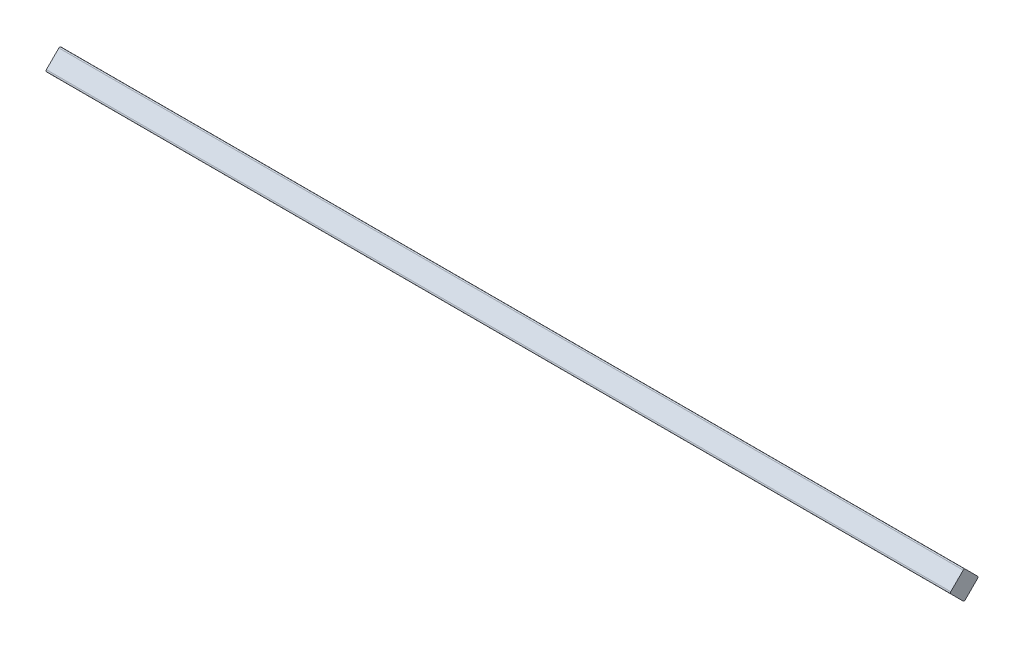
from build123d import *

# Parameters (mm, degrees)
EXTRUDE_L_NGD_DEPTH     = 2000
FILLET_KANTAVRUNDNING_R = 3


with BuildPart() as part:
    # Sketch1 → Extrude l_ngd (new body)
    with BuildSketch(Plane(origin=(0, 0, 0), x_dir=(0, 0, -1), z_dir=(1, 0, 0))):
        Polygon((0, 31.819805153), (-31.819805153, 0), (0, -31.819805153), (31.819805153, 0), align=None)
    extrude(amount=EXTRUDE_L_NGD_DEPTH)

    # Fillet kantavrundning
    fillet_kantavrundning_edges = [part.edges().sort_by_distance(p)[0] for p in [
        (1000, 0, -31.819805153),
        (1000, -31.819805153, 0),
        (1000, 0, 31.819805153),
        (1000, 31.819805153, 0),
    ]]
    fillet(fillet_kantavrundning_edges, radius=FILLET_KANTAVRUNDNING_R)


solid = part.part
